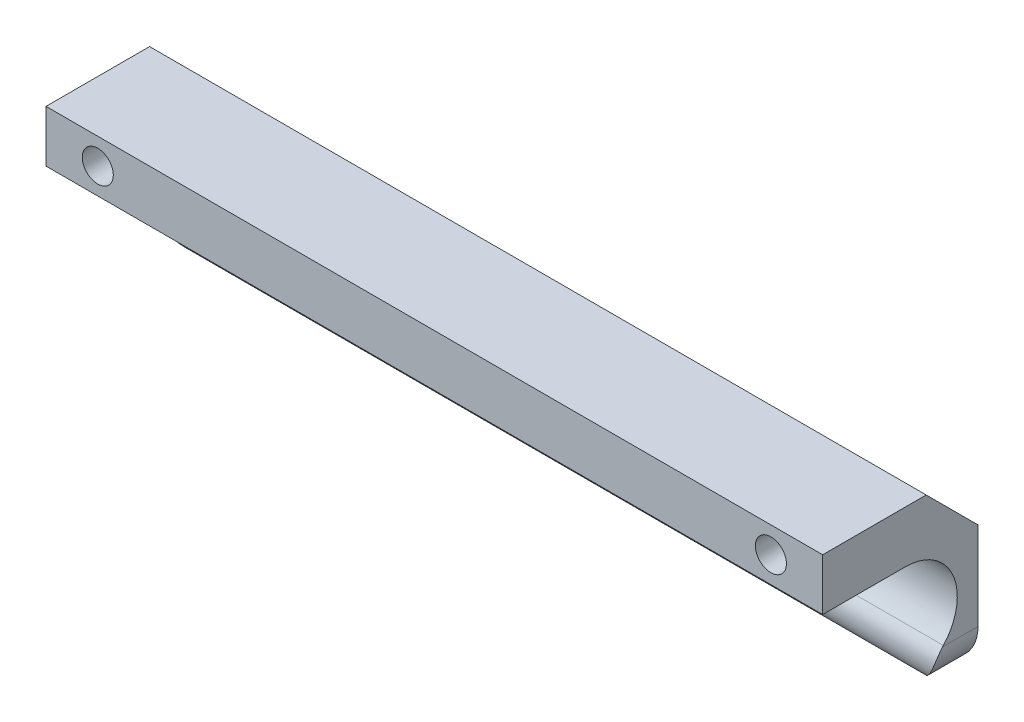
from build123d import *

# Parameters (mm, degrees)
SKETCH1_W      = 30
SKETCH1_H      = 35
EXTRUDE1_DEPTH = 75
CHAMFER1_SIZE  = 10
EXTRUDE2_DEPTH = 150
EXTRUDE3_DEPTH = 83.651376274


with BuildPart() as part:
    # Sketch1 → Extrude1 (new, symmetric)
    with BuildSketch(Plane(origin=(0, 0, 0), x_dir=(0, 0, -1), z_dir=(1, 0, 0))):
        Rectangle(SKETCH1_W, SKETCH1_H)
    extrude(amount=EXTRUDE1_DEPTH, both=True)

    # Chamfer1
    chamfer1_edges = [part.edges().sort_by_distance(p)[0] for p in [
        (0, 17.5, -15),
    ]]
    chamfer(chamfer1_edges, length=CHAMFER1_SIZE)

    # Sketch2 → Extrude2 (cut)
    with BuildSketch(Plane(origin=(75, 0, 0), x_dir=(0, 0, -1), z_dir=(1, 0, 0))):
        with BuildLine():
            ThreePointArc((8.30782305, -9.326105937), (10.172269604, 1.483650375), (1, 7.5))
            Line((1, 7.5), (-15, 7.5))
            Line((-15, 7.5), (-15, -17.5))
            Line((-15, -17.5), (11.857864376, -17.5))
            ThreePointArc((11.857864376, -17.5), (7.4021002, -14.577338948), (8.30782305, -9.326105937))
        make_face()
        with BuildLine():
            ThreePointArc((15, -16.346974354), (13.531370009, -17.202642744), (11.857864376, -17.5))
            Line((11.857864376, -17.5), (15, -17.5))
            Line((15, -17.5), (15, -16.346974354))
        make_face()
    extrude(amount=-EXTRUDE2_DEPTH, mode=Mode.SUBTRACT)

    # Sketch3 → Extrude3 (cut, through all)
    with BuildSketch(Plane(origin=(0, 0, -15), x_dir=(-1, 0, 0), z_dir=(0, 0, -1))):
        with BuildLine():
            Line((-75, -17.5), (-75, -9.5))
            ThreePointArc((-75, -9.5), (-72.656854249, -15.156854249), (-67, -17.5))
            Line((-67, -17.5), (-75, -17.5))
        make_face()
        with BuildLine():
            Line((75, -17.5), (75, -9.5))
            ThreePointArc((75, -9.5), (72.656854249, -15.156854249), (67, -17.5))
            Line((67, -17.5), (75, -17.5))
        make_face()
    extrude(amount=-EXTRUDE3_DEPTH, mode=Mode.SUBTRACT)

    # Sketch4 → M6x1.0 Tapped Hole1 (revolve, cut)
    with BuildSketch(Plane(origin=(-65, 12.5, 15), x_dir=(0, -1, 0), z_dir=(1, 0, 0))):
        Polygon((0, 0), (0, 18.502151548), (2.5, 17), (2.5, 12), (3, 12), (3, 0), align=None)
    m6x1_0_tapped_hole1 = revolve(axis=Axis((-65, 12.5, 21.35), (0, 0, -1)), mode=Mode.SUBTRACT)

    # Mirror1: M6x1.0 Tapped Hole1 across plane
    add(m6x1_0_tapped_hole1.mirror(Plane(origin=(0, 0, 0), x_dir=(0, 0, 1), z_dir=(1, 0, 0))), mode=Mode.SUBTRACT)


solid = part.part
